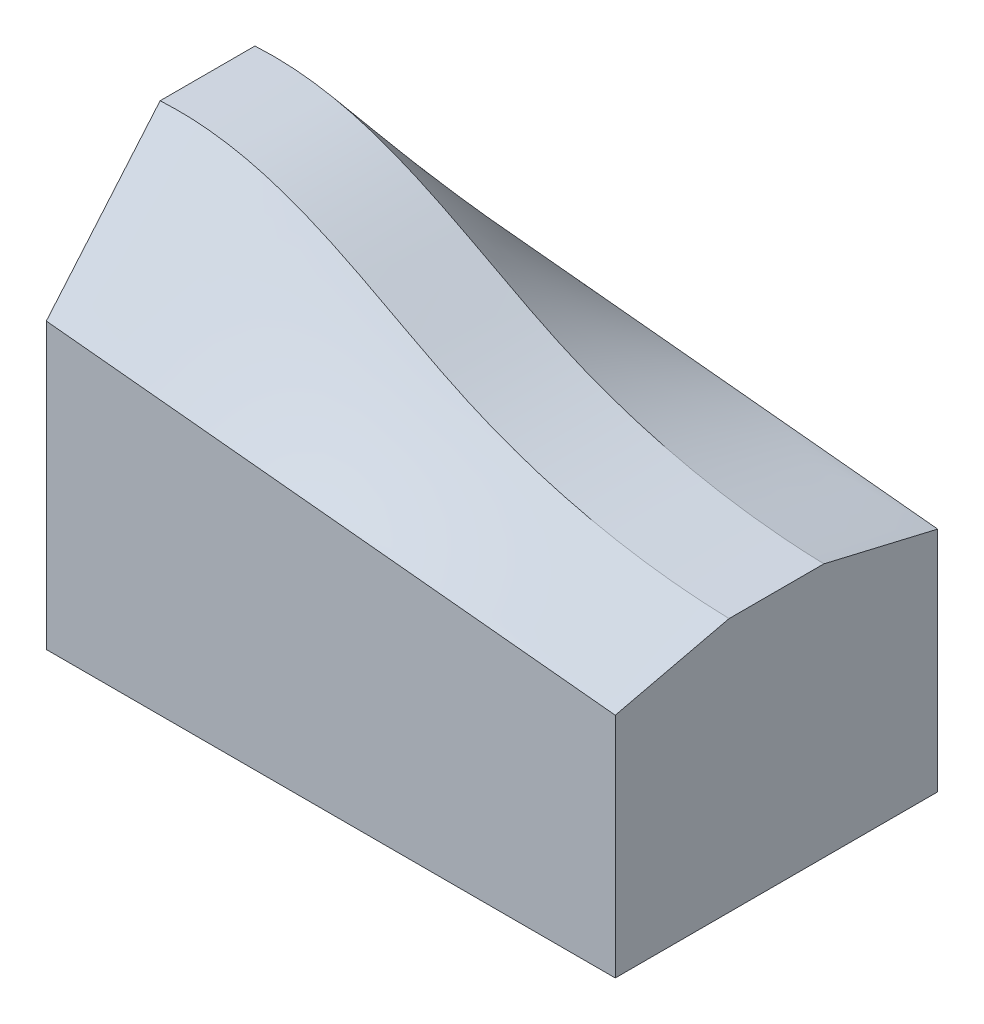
ISO-10303-21;
HEADER;
FILE_DESCRIPTION(('STEP AP214'),'2;1');
FILE_NAME('part.step','',(''),(''),'','','');
FILE_SCHEMA(('AUTOMOTIVE_DESIGN { 1 0 10303 214 1 1 1 1 }'));
ENDSEC;
DATA;
#1=APPLICATION_CONTEXT('core data for automotive mechanical design processes');
#2=APPLICATION_PROTOCOL_DEFINITION('international standard','automotive_design',2000,#1);
#3=PRODUCT_CONTEXT('',#1,'mechanical');
#4=PRODUCT('Part','Part','',(#3));
#5=PRODUCT_RELATED_PRODUCT_CATEGORY('part','',(#4));
#6=PRODUCT_DEFINITION_FORMATION('','',#4);
#7=PRODUCT_DEFINITION_CONTEXT('part definition',#1,'design');
#8=PRODUCT_DEFINITION('design','',#6,#7);
#9=PRODUCT_DEFINITION_SHAPE('','',#8);
#10=(LENGTH_UNIT() NAMED_UNIT(*) SI_UNIT(.MILLI.,.METRE.));
#11=(NAMED_UNIT(*) PLANE_ANGLE_UNIT() SI_UNIT($,.RADIAN.));
#12=(NAMED_UNIT(*) SI_UNIT($,.STERADIAN.) SOLID_ANGLE_UNIT());
#13=UNCERTAINTY_MEASURE_WITH_UNIT(LENGTH_MEASURE(1.E-05),#10,'distance_accuracy_value','');
#14=(GEOMETRIC_REPRESENTATION_CONTEXT(3) GLOBAL_UNCERTAINTY_ASSIGNED_CONTEXT((#13)) GLOBAL_UNIT_ASSIGNED_CONTEXT((#10,
#11,#12)) REPRESENTATION_CONTEXT('',''));
#15=CARTESIAN_POINT('',(0.,0.,0.));
#16=DIRECTION('',(0.,0.,1.));
#17=DIRECTION('',(1.,0.,0.));
#18=AXIS2_PLACEMENT_3D('',#15,#16,#17);
#19=CARTESIAN_POINT('',(3.16358629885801,7.32596468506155,2.50000000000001));
#20=CARTESIAN_POINT('',(2.63634932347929,7.34026394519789,2.50000000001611));
#21=CARTESIAN_POINT('',(2.10909878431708,7.35456357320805,2.50000000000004));
#22=CARTESIAN_POINT('',(1.31820231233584,7.37601357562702,2.50000000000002));
#23=CARTESIAN_POINT('',(1.05456671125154,7.38316366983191,2.50000000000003));
#24=CARTESIAN_POINT('',(0.659108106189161,7.39388895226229,2.50000000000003));
#25=CARTESIAN_POINT('',(0.527287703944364,7.39746406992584,2.50000000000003));
#26=CARTESIAN_POINT('',(0.263645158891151,7.40461435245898,2.50000000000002));
#27=CARTESIAN_POINT('',(0.131823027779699,7.40818947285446,2.50000018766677));
#28=CARTESIAN_POINT('',(-0.164778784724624,7.41623374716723,2.49999976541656));
#29=CARTESIAN_POINT('',(-0.289547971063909,7.42042110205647,2.49999999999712));
#30=CARTESIAN_POINT('',(-0.57800217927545,7.43143505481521,2.50000000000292));
#31=CARTESIAN_POINT('',(-0.72200883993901,7.43772946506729,2.49999999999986));
#32=CARTESIAN_POINT('',(-1.15339398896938,7.45895841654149,2.50000000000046));
#33=CARTESIAN_POINT('',(-1.4401375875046,7.47623749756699,2.49999999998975));
#34=CARTESIAN_POINT('',(-2.29804392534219,7.5373645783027,2.50000000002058));
#35=CARTESIAN_POINT('',(-2.86688276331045,7.59048407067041,2.50000000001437));
#36=CARTESIAN_POINT('',(-4.5658331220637,7.78690213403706,2.49999999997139));
#37=CARTESIAN_POINT('',(-5.68843891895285,7.96695883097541,2.50000000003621));
#38=CARTESIAN_POINT('',(-7.922081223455,8.4321767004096,2.49999999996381));
#39=CARTESIAN_POINT('',(-9.03819871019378,8.7189642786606,2.50000000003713));
#40=CARTESIAN_POINT('',(-11.2378363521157,9.40598581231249,2.49999999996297));
#41=CARTESIAN_POINT('',(-12.3193114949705,9.80496227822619,2.50000000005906));
#42=CARTESIAN_POINT('',(-14.4444547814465,10.7305007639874,2.49999999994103));
#43=CARTESIAN_POINT('',(-15.5453785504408,11.28619009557,2.49999999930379));
#44=CARTESIAN_POINT('',(-17.9244576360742,12.5421425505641,2.50000000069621));
#45=CARTESIAN_POINT('',(-19.1963021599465,13.2411888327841,2.49999999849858));
#46=CARTESIAN_POINT('',(-21.9403008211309,14.5553199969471,2.50000000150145));
#47=CARTESIAN_POINT('',(-23.4083820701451,15.1626577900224,2.49999999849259));
#48=CARTESIAN_POINT('',(-25.7844350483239,15.7704303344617,2.50000000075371));
#49=CARTESIAN_POINT('',(-26.6046193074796,15.9218251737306,2.49999999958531));
#50=CARTESIAN_POINT('',(-27.8687220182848,16.0493421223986,2.50000000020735));
#51=CARTESIAN_POINT('',(-28.295378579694,16.0752174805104,2.50000000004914));
#52=CARTESIAN_POINT('',(-28.9344923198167,16.0881115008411,2.49999999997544));
#53=CARTESIAN_POINT('',(-29.147674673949,16.0881379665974,2.50000000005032));
#54=CARTESIAN_POINT('',(-29.5739723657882,16.0797574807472,2.49999999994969));
#55=CARTESIAN_POINT('',(-29.787087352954,16.0713484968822,2.50000207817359));
#56=CARTESIAN_POINT('',(-30.0851650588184,16.0538135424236,2.49999916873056));
#57=CARTESIAN_POINT('',(-30.1410391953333,16.0505250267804,2.5));
#58=CARTESIAN_POINT('',(-30.2719385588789,16.0428231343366,2.49999999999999));
#59=CARTESIAN_POINT('',(-30.3373886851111,16.0389721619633,2.50000000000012));
#60=CARTESIAN_POINT('',(-30.5337404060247,16.0274191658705,2.49999999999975));
#61=CARTESIAN_POINT('',(-30.6646433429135,16.019717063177,2.49999999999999));
#62=CARTESIAN_POINT('',(-31.057357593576,15.9966104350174,2.5));
#63=CARTESIAN_POINT('',(-31.3191743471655,15.9812055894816,2.50000000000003));
#64=CARTESIAN_POINT('',(-32.104646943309,15.9349897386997,2.49999999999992));
#65=CARTESIAN_POINT('',(-32.6283251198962,15.904177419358,2.49999999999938));
#66=CARTESIAN_POINT('',(-33.1520346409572,15.8733632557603,2.5));
#67=CARTESIAN_POINT('',(3.163586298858,7.32596468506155,-2.49999999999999));
#68=CARTESIAN_POINT('',(2.6363493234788,7.3402639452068,-2.49999999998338));
#69=CARTESIAN_POINT('',(2.10909878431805,7.35456357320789,-2.50000000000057));
#70=CARTESIAN_POINT('',(1.31820231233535,7.37601357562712,-2.49999999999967));
#71=CARTESIAN_POINT('',(1.05456671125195,7.38316366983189,-2.50000000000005));
#72=CARTESIAN_POINT('',(0.659108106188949,7.39388895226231,-2.49999999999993));
#73=CARTESIAN_POINT('',(0.527287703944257,7.3974640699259,-2.49999999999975));
#74=CARTESIAN_POINT('',(0.263645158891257,7.40461435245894,-2.50000000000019));
#75=CARTESIAN_POINT('',(0.131823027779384,7.40818947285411,-2.50000018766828));
#76=CARTESIAN_POINT('',(-0.164778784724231,7.41623374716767,-2.49999976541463));
#77=CARTESIAN_POINT('',(-0.28954797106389,7.42042110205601,-2.49999999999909));
#78=CARTESIAN_POINT('',(-0.578002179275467,7.43143505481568,-2.50000000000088));
#79=CARTESIAN_POINT('',(-0.722008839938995,7.43772946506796,-2.49999999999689));
#80=CARTESIAN_POINT('',(-1.1533939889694,7.45895841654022,-2.50000000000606));
#81=CARTESIAN_POINT('',(-1.44013758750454,7.47623749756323,-2.50000000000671));
#82=CARTESIAN_POINT('',(-2.29804392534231,7.53736457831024,-2.49999999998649));
#83=CARTESIAN_POINT('',(-2.86688276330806,7.59048407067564,-2.49999999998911));
#84=CARTESIAN_POINT('',(-4.56583312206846,7.78690213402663,-2.50000000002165));
#85=CARTESIAN_POINT('',(-5.68843891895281,7.96695883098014,-2.50000000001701));
#86=CARTESIAN_POINT('',(-7.92208122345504,8.43217670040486,-2.49999999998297));
#87=CARTESIAN_POINT('',(-9.03819871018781,8.71896427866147,-2.50000000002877));
#88=CARTESIAN_POINT('',(-11.2378363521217,9.40598581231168,-2.49999999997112));
#89=CARTESIAN_POINT('',(-12.3193114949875,9.8049622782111,-2.500000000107));
#90=CARTESIAN_POINT('',(-14.4444547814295,10.7305007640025,-2.49999999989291));
#91=CARTESIAN_POINT('',(-15.5453785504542,11.2861900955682,-2.49999999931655));
#92=CARTESIAN_POINT('',(-17.9244576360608,12.542142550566,-2.50000000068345));
#93=CARTESIAN_POINT('',(-19.1963021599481,13.2411888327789,-2.49999999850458));
#94=CARTESIAN_POINT('',(-21.9403008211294,14.5553199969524,-2.50000000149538));
#95=CARTESIAN_POINT('',(-23.4083820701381,15.1626577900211,-2.49999999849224));
#96=CARTESIAN_POINT('',(-25.7844350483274,15.7704303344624,-2.50000000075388));
#97=CARTESIAN_POINT('',(-26.604619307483,15.9218251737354,-2.49999999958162));
#98=CARTESIAN_POINT('',(-27.8687220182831,16.0493421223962,-2.50000000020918));
#99=CARTESIAN_POINT('',(-28.2953785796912,16.0752174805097,-2.50000000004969));
#100=CARTESIAN_POINT('',(-28.9344923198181,16.0881115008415,-2.49999999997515));
#101=CARTESIAN_POINT('',(-29.1476746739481,16.0881379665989,-2.50000000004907));
#102=CARTESIAN_POINT('',(-29.5739723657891,16.0797574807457,-2.49999999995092));
#103=CARTESIAN_POINT('',(-29.787087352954,16.0713484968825,-2.5000020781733));
#104=CARTESIAN_POINT('',(-30.0851650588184,16.0538135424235,-2.49999916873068));
#105=CARTESIAN_POINT('',(-30.1410391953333,16.0505250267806,-2.49999999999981));
#106=CARTESIAN_POINT('',(-30.2719385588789,16.0428231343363,-2.5000000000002));
#107=CARTESIAN_POINT('',(-30.3373886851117,16.0389721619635,-2.49999999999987));
#108=CARTESIAN_POINT('',(-30.5337404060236,16.02741916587,-2.50000000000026));
#109=CARTESIAN_POINT('',(-30.6646433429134,16.019717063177,-2.5));
#110=CARTESIAN_POINT('',(-31.057357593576,15.9966104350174,-2.50000000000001));
#111=CARTESIAN_POINT('',(-31.3191743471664,15.9812055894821,-2.49999999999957));
#112=CARTESIAN_POINT('',(-32.1046469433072,15.9349897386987,-2.50000000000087));
#113=CARTESIAN_POINT('',(-32.6283251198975,15.9041774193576,-2.49999999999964));
#114=CARTESIAN_POINT('',(-33.1520346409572,15.8733632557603,-2.5));
#115=B_SPLINE_SURFACE_WITH_KNOTS('',1,3,((#19,#20,#21,#22,#23,#24,#25,#26,#27,#28,#29,#30,#31,
#32,#33,#34,#35,#36,#37,#38,#39,#40,#41,#42,#43,#44,#45,#46,#47,#48,#49,#50,#51,#52,#53,#54,#55,
#56,#57,#58,#59,#60,#61,#62,#63,#64,#65,#66),(#67,#68,#69,#70,#71,#72,#73,#74,#75,#76,#77,#78,
#79,#80,#81,#82,#83,#84,#85,#86,#87,#88,#89,#90,#91,#92,#93,#94,#95,#96,#97,#98,#99,#100,#101,
#102,#103,#104,#105,#106,#107,#108,#109,#110,#111,#112,#113,#114)),.UNSPECIFIED.,.F.,.F.,.F.,(2,
2),(4,2,2,2,2,2,2,2,2,2,2,2,2,2,2,2,2,2,2,2,2,2,2,4),(0.,1.),(0.00714343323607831,
0.00872139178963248,0.00951037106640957,0.00990486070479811,0.0102993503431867,
0.0107924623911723,0.011285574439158,0.0122717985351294,0.0142442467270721,0.0181891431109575,
0.0221340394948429,0.0260789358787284,0.0300238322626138,0.0339687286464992,0.0379136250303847,
0.0398860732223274,0.0408722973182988,0.0413654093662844,0.0418585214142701,0.0420557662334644,
0.0422530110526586,0.0426475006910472,0.0434364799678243,0.0450144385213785),.UNSPECIFIED.);
#116=CARTESIAN_POINT('',(0.,7.41176470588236,2.50000000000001));
#117=CARTESIAN_POINT('',(-4.5771550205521,7.53590230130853,2.50000000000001));
#118=CARTESIAN_POINT('',(-15.3083363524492,9.67056029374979,2.50000000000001));
#119=CARTESIAN_POINT('',(-23.2907730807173,16.4535828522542,2.50000000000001));
#120=CARTESIAN_POINT('',(-30.,16.0588235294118,2.50000000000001));
#121=B_SPLINE_CURVE_WITH_KNOTS('',3,(#116,#117,#118,#119,#120),.UNSPECIFIED.,.F.,.F.,(4,1,4),
(0.,0.43459880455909,1.),.UNSPECIFIED.);
#122=CARTESIAN_POINT('',(0.,7.41176470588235,2.50000000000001));
#123=VERTEX_POINT('',#122);
#124=CARTESIAN_POINT('',(-30.,16.0588235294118,2.5));
#125=VERTEX_POINT('',#124);
#126=EDGE_CURVE('E330',#123,#125,#121,.T.);
#127=DIRECTION('',(0.,0.,-1.));
#128=VECTOR('',#127,1.);
#129=CARTESIAN_POINT('',(0.,7.41176470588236,-2.49999999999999));
#130=LINE('',#129,#128);
#131=CARTESIAN_POINT('',(0.,7.41176470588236,-2.49999999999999));
#132=VERTEX_POINT('',#131);
#133=EDGE_CURVE('E119',#132,#123,#130,.F.);
#134=CARTESIAN_POINT('',(-30.,16.0588235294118,-2.5));
#135=CARTESIAN_POINT('',(-23.2907730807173,16.4535828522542,-2.5));
#136=CARTESIAN_POINT('',(-15.3083363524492,9.67056029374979,-2.5));
#137=CARTESIAN_POINT('',(-4.57715502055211,7.53590230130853,-2.5));
#138=CARTESIAN_POINT('',(0.,7.41176470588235,-2.5));
#139=B_SPLINE_CURVE_WITH_KNOTS('',3,(#134,#135,#136,#137,#138),.UNSPECIFIED.,.F.,.F.,(4,1,4),
(0.,0.56540119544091,1.),.UNSPECIFIED.);
#140=CARTESIAN_POINT('',(-30.,16.0588235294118,-2.5));
#141=VERTEX_POINT('',#140);
#142=EDGE_CURVE('E454',#141,#132,#139,.T.);
#143=DIRECTION('',(0.,0.,-1.));
#144=VECTOR('',#143,1.);
#145=CARTESIAN_POINT('',(-30.,16.0588235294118,2.5));
#146=LINE('',#145,#144);
#147=EDGE_CURVE('E14',#125,#141,#146,.T.);
#148=ORIENTED_EDGE('',*,*,#126,.F.);
#149=ORIENTED_EDGE('',*,*,#133,.F.);
#150=ORIENTED_EDGE('',*,*,#142,.F.);
#151=ORIENTED_EDGE('',*,*,#147,.F.);
#152=EDGE_LOOP('',(#148,#149,#150,#151));
#153=FACE_BOUND('',#152,.T.);
#154=ADVANCED_FACE('F107',(#153),#115,.T.);
#155=CARTESIAN_POINT('',(-30.,0.,0.));
#156=DIRECTION('',(1.,0.,0.));
#157=DIRECTION('',(0.,0.,-1.));
#158=AXIS2_PLACEMENT_3D('',#155,#156,#157);
#159=PLANE('',#158);
#160=DIRECTION('',(0.,-0.761939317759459,0.64764842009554));
#161=VECTOR('',#160,1.);
#162=CARTESIAN_POINT('',(-30.,9.,8.5));
#163=LINE('',#162,#161);
#164=CARTESIAN_POINT('',(-30.,9.,8.5));
#165=VERTEX_POINT('',#164);
#166=EDGE_CURVE('E328',#125,#165,#163,.T.);
#167=ORIENTED_EDGE('',*,*,#166,.F.);
#168=ORIENTED_EDGE('',*,*,#147,.T.);
#169=DIRECTION('',(0.,0.761939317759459,0.647648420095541));
#170=VECTOR('',#169,1.);
#171=CARTESIAN_POINT('',(-30.,19.,0.));
#172=LINE('',#171,#170);
#173=CARTESIAN_POINT('',(-30.,9.,-8.5));
#174=VERTEX_POINT('',#173);
#175=EDGE_CURVE('E279',#174,#141,#172,.T.);
#176=ORIENTED_EDGE('',*,*,#175,.F.);
#177=DIRECTION('',(0.,1.,0.));
#178=VECTOR('',#177,1.);
#179=CARTESIAN_POINT('',(-30.,-6.,-8.5));
#180=LINE('',#179,#178);
#181=CARTESIAN_POINT('',(-30.,-6.,-8.5));
#182=VERTEX_POINT('',#181);
#183=EDGE_CURVE('E358',#182,#174,#180,.T.);
#184=ORIENTED_EDGE('',*,*,#183,.F.);
#185=DIRECTION('',(0.,0.,-1.));
#186=VECTOR('',#185,1.);
#187=CARTESIAN_POINT('',(-30.,-6.,8.5));
#188=LINE('',#187,#186);
#189=CARTESIAN_POINT('',(-30.,-6.,8.49999999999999));
#190=VERTEX_POINT('',#189);
#191=EDGE_CURVE('E198',#190,#182,#188,.T.);
#192=ORIENTED_EDGE('',*,*,#191,.F.);
#193=DIRECTION('',(0.,-1.,0.));
#194=VECTOR('',#193,1.);
#195=CARTESIAN_POINT('',(-30.,-6.,8.5));
#196=LINE('',#195,#194);
#197=EDGE_CURVE('E331',#165,#190,#196,.T.);
#198=ORIENTED_EDGE('',*,*,#197,.F.);
#199=EDGE_LOOP('',(#167,#168,#176,#184,#192,#198));
#200=FACE_BOUND('',#199,.T.);
#201=ADVANCED_FACE('F251',(#200),#159,.F.);
#202=CARTESIAN_POINT('',(0.,0.,0.));
#203=DIRECTION('',(1.,0.,0.));
#204=DIRECTION('',(0.,0.,-1.));
#205=AXIS2_PLACEMENT_3D('',#202,#203,#204);
#206=PLANE('',#205);
#207=DIRECTION('',(0.,0.229039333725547,0.973417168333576));
#208=VECTOR('',#207,1.);
#209=CARTESIAN_POINT('',(0.,8.,0.));
#210=LINE('',#209,#208);
#211=CARTESIAN_POINT('',(0.,6.,-8.5));
#212=VERTEX_POINT('',#211);
#213=EDGE_CURVE('E192',#212,#132,#210,.T.);
#214=ORIENTED_EDGE('',*,*,#213,.T.);
#215=ORIENTED_EDGE('',*,*,#133,.T.);
#216=DIRECTION('',(0.,-0.229039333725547,0.973417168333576));
#217=VECTOR('',#216,1.);
#218=CARTESIAN_POINT('',(0.,6.,8.5));
#219=LINE('',#218,#217);
#220=CARTESIAN_POINT('',(0.,6.,8.5));
#221=VERTEX_POINT('',#220);
#222=EDGE_CURVE('E204',#123,#221,#219,.T.);
#223=ORIENTED_EDGE('',*,*,#222,.T.);
#224=DIRECTION('',(0.,-1.,0.));
#225=VECTOR('',#224,1.);
#226=CARTESIAN_POINT('',(0.,-6.,8.5));
#227=LINE('',#226,#225);
#228=CARTESIAN_POINT('',(0.,-6.,8.5));
#229=VERTEX_POINT('',#228);
#230=EDGE_CURVE('E173',#221,#229,#227,.T.);
#231=ORIENTED_EDGE('',*,*,#230,.T.);
#232=DIRECTION('',(0.,0.,-1.));
#233=VECTOR('',#232,1.);
#234=CARTESIAN_POINT('',(0.,-6.,8.5));
#235=LINE('',#234,#233);
#236=CARTESIAN_POINT('',(0.,-6.,-8.5));
#237=VERTEX_POINT('',#236);
#238=EDGE_CURVE('E164',#229,#237,#235,.T.);
#239=ORIENTED_EDGE('',*,*,#238,.T.);
#240=DIRECTION('',(0.,1.,0.));
#241=VECTOR('',#240,1.);
#242=CARTESIAN_POINT('',(0.,-6.,-8.5));
#243=LINE('',#242,#241);
#244=EDGE_CURVE('E169',#237,#212,#243,.T.);
#245=ORIENTED_EDGE('',*,*,#244,.T.);
#246=EDGE_LOOP('',(#214,#215,#223,#231,#239,#245));
#247=FACE_BOUND('',#246,.T.);
#248=ADVANCED_FACE('F168',(#247),#206,.T.);
#249=CARTESIAN_POINT('',(0.,6.,8.5));
#250=CARTESIAN_POINT('',(-4.3459880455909,6.43459880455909,8.5));
#251=CARTESIAN_POINT('',(-14.3459880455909,7.43459880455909,8.5));
#252=CARTESIAN_POINT('',(-24.3459880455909,8.43459880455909,8.5));
#253=CARTESIAN_POINT('',(-30.,9.,8.5));
#254=CARTESIAN_POINT('',(0.,6.16666666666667,7.79166666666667));
#255=CARTESIAN_POINT('',(-4.37327859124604,6.56461380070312,7.79166666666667));
#256=CARTESIAN_POINT('',(-14.459598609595,7.69856648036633,7.79166666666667));
#257=CARTESIAN_POINT('',(-24.2214140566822,9.38128442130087,7.79166666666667));
#258=CARTESIAN_POINT('',(-30.,9.83333333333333,7.79166666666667));
#259=CARTESIAN_POINT('',(0.,6.50000000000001,6.375));
#260=CARTESIAN_POINT('',(-4.42785968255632,6.8246437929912,6.375));
#261=CARTESIAN_POINT('',(-14.6868197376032,8.22650183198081,6.375));
#262=CARTESIAN_POINT('',(-23.9722660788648,11.2746556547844,6.37499999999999));
#263=CARTESIAN_POINT('',(-30.,11.5,6.37499999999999));
#264=CARTESIAN_POINT('',(0.,6.99999999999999,4.25000000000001));
#265=CARTESIAN_POINT('',(-4.50973131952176,7.21468878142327,4.25000000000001));
#266=CARTESIAN_POINT('',(-15.0276514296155,9.0184048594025,4.25000000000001));
#267=CARTESIAN_POINT('',(-23.5985441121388,14.1147125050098,4.25000000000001));
#268=CARTESIAN_POINT('',(-30.,14.,4.25000000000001));
#269=CARTESIAN_POINT('',(0.,7.50000000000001,2.12499999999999));
#270=CARTESIAN_POINT('',(-4.59160295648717,7.60473376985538,2.12499999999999));
#271=CARTESIAN_POINT('',(-15.3684831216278,9.81030788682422,2.12499999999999));
#272=CARTESIAN_POINT('',(-23.2248221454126,16.9547693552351,2.12499999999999));
#273=CARTESIAN_POINT('',(-30.,16.5,2.12499999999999));
#274=CARTESIAN_POINT('',(0.,7.83333333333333,0.708333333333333));
#275=CARTESIAN_POINT('',(-4.64618404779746,7.86476376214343,0.708333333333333));
#276=CARTESIAN_POINT('',(-15.5957042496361,10.3382432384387,0.708333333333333));
#277=CARTESIAN_POINT('',(-22.9756741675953,18.8481405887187,0.708333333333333));
#278=CARTESIAN_POINT('',(-30.,18.1666666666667,0.708333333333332));
#279=CARTESIAN_POINT('',(0.,8.,0.));
#280=CARTESIAN_POINT('',(-4.67347459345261,7.99477875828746,0.));
#281=CARTESIAN_POINT('',(-15.7093148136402,10.6022109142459,0.));
#282=CARTESIAN_POINT('',(-22.8511001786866,19.7948262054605,0.));
#283=CARTESIAN_POINT('',(-30.,19.,0.));
#284=B_SPLINE_SURFACE_WITH_KNOTS('',3,3,((#249,#250,#251,#252,#253),(#254,#255,#256,#257,#258),
(#259,#260,#261,#262,#263),(#264,#265,#266,#267,#268),(#269,#270,#271,#272,#273),(#274,#275,
#276,#277,#278),(#279,#280,#281,#282,#283)),.UNSPECIFIED.,.F.,.F.,.F.,(4,1,1,1,4),(4,1,4),
(0.835732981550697,0.876799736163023,0.917866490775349,0.958933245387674,1.),(0.,
0.43459880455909,1.),.UNSPECIFIED.);
#285=CARTESIAN_POINT('',(0.,6.,8.5));
#286=CARTESIAN_POINT('',(-4.3459880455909,6.43459880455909,8.5));
#287=CARTESIAN_POINT('',(-14.3459880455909,7.43459880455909,8.5));
#288=CARTESIAN_POINT('',(-24.3459880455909,8.43459880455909,8.5));
#289=CARTESIAN_POINT('',(-30.,9.,8.5));
#290=B_SPLINE_CURVE_WITH_KNOTS('',3,(#285,#286,#287,#288,#289),.UNSPECIFIED.,.F.,.F.,(4,1,4),
(0.,0.43459880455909,1.),.UNSPECIFIED.);
#291=EDGE_CURVE('E202',#221,#165,#290,.T.);
#292=ORIENTED_EDGE('',*,*,#222,.F.);
#293=ORIENTED_EDGE('',*,*,#126,.T.);
#294=ORIENTED_EDGE('',*,*,#166,.T.);
#295=ORIENTED_EDGE('',*,*,#291,.F.);
#296=EDGE_LOOP('',(#292,#293,#294,#295));
#297=FACE_BOUND('',#296,.T.);
#298=ADVANCED_FACE('F232',(#297),#284,.T.);
#299=CARTESIAN_POINT('',(0.,-6.,8.5));
#300=DIRECTION('',(0.,0.,1.));
#301=DIRECTION('',(0.,1.,0.));
#302=AXIS2_PLACEMENT_3D('',#299,#300,#301);
#303=PLANE('',#302);
#304=ORIENTED_EDGE('',*,*,#230,.F.);
#305=ORIENTED_EDGE('',*,*,#291,.T.);
#306=ORIENTED_EDGE('',*,*,#197,.T.);
#307=CARTESIAN_POINT('',(0.,-6.,8.5));
#308=CARTESIAN_POINT('',(-4.3459880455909,-6.,8.5));
#309=CARTESIAN_POINT('',(-14.3459880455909,-6.,8.5));
#310=CARTESIAN_POINT('',(-24.3459880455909,-6.,8.5));
#311=CARTESIAN_POINT('',(-30.,-6.,8.49999999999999));
#312=B_SPLINE_CURVE_WITH_KNOTS('',3,(#307,#308,#309,#310,#311),.UNSPECIFIED.,.F.,.F.,(4,1,4),
(0.,0.43459880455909,1.),.UNSPECIFIED.);
#313=EDGE_CURVE('E200',#229,#190,#312,.T.);
#314=ORIENTED_EDGE('',*,*,#313,.F.);
#315=EDGE_LOOP('',(#304,#305,#306,#314));
#316=FACE_BOUND('',#315,.T.);
#317=ADVANCED_FACE('F244',(#316),#303,.T.);
#318=CARTESIAN_POINT('',(0.,-6.,-8.5));
#319=DIRECTION('',(0.,-1.,0.));
#320=DIRECTION('',(0.,0.,1.));
#321=AXIS2_PLACEMENT_3D('',#318,#319,#320);
#322=PLANE('',#321);
#323=ORIENTED_EDGE('',*,*,#238,.F.);
#324=ORIENTED_EDGE('',*,*,#313,.T.);
#325=ORIENTED_EDGE('',*,*,#191,.T.);
#326=CARTESIAN_POINT('',(0.,-6.,-8.5));
#327=CARTESIAN_POINT('',(-4.3459880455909,-6.,-8.5));
#328=CARTESIAN_POINT('',(-14.3459880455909,-6.,-8.5));
#329=CARTESIAN_POINT('',(-24.3459880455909,-6.,-8.5));
#330=CARTESIAN_POINT('',(-30.,-6.,-8.5));
#331=B_SPLINE_CURVE_WITH_KNOTS('',3,(#326,#327,#328,#329,#330),.UNSPECIFIED.,.F.,.F.,(4,1,4),
(0.,0.43459880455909,1.),.UNSPECIFIED.);
#332=EDGE_CURVE('E188',#237,#182,#331,.T.);
#333=ORIENTED_EDGE('',*,*,#332,.F.);
#334=EDGE_LOOP('',(#323,#324,#325,#333));
#335=FACE_BOUND('',#334,.T.);
#336=ADVANCED_FACE('F196',(#335),#322,.T.);
#337=CARTESIAN_POINT('',(0.,6.,-8.5));
#338=DIRECTION('',(0.,0.,-1.));
#339=DIRECTION('',(0.,-1.,0.));
#340=AXIS2_PLACEMENT_3D('',#337,#338,#339);
#341=PLANE('',#340);
#342=ORIENTED_EDGE('',*,*,#244,.F.);
#343=ORIENTED_EDGE('',*,*,#332,.T.);
#344=ORIENTED_EDGE('',*,*,#183,.T.);
#345=CARTESIAN_POINT('',(0.,6.,-8.5));
#346=CARTESIAN_POINT('',(-4.3459880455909,6.43459880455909,-8.5));
#347=CARTESIAN_POINT('',(-14.3459880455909,7.43459880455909,-8.5));
#348=CARTESIAN_POINT('',(-24.3459880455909,8.43459880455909,-8.5));
#349=CARTESIAN_POINT('',(-30.,9.,-8.5));
#350=B_SPLINE_CURVE_WITH_KNOTS('',3,(#345,#346,#347,#348,#349),.UNSPECIFIED.,.F.,.F.,(4,1,4),
(0.,0.43459880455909,1.),.UNSPECIFIED.);
#351=EDGE_CURVE('E191',#212,#174,#350,.T.);
#352=ORIENTED_EDGE('',*,*,#351,.F.);
#353=EDGE_LOOP('',(#342,#343,#344,#352));
#354=FACE_BOUND('',#353,.T.);
#355=ADVANCED_FACE('F187',(#354),#341,.T.);
#356=CARTESIAN_POINT('',(0.,8.,0.));
#357=CARTESIAN_POINT('',(-4.67347459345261,7.99477875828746,0.));
#358=CARTESIAN_POINT('',(-15.7093148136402,10.6022109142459,0.));
#359=CARTESIAN_POINT('',(-22.8511001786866,19.7948262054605,0.));
#360=CARTESIAN_POINT('',(-30.,19.,0.));
#361=CARTESIAN_POINT('',(0.,7.83333333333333,-0.708333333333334));
#362=CARTESIAN_POINT('',(-4.64618404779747,7.86476376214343,-0.708333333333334));
#363=CARTESIAN_POINT('',(-15.5957042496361,10.3382432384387,-0.708333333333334));
#364=CARTESIAN_POINT('',(-22.9756741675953,18.8481405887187,-0.708333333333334));
#365=CARTESIAN_POINT('',(-30.,18.1666666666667,-0.708333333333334));
#366=CARTESIAN_POINT('',(0.,7.5,-2.125));
#367=CARTESIAN_POINT('',(-4.59160295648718,7.60473376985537,-2.125));
#368=CARTESIAN_POINT('',(-15.3684831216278,9.81030788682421,-2.125));
#369=CARTESIAN_POINT('',(-23.2248221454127,16.9547693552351,-2.125));
#370=CARTESIAN_POINT('',(-30.,16.5,-2.125));
#371=CARTESIAN_POINT('',(0.,7.,-4.25000000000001));
#372=CARTESIAN_POINT('',(-4.50973131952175,7.21468878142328,-4.25000000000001));
#373=CARTESIAN_POINT('',(-15.0276514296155,9.01840485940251,-4.25000000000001));
#374=CARTESIAN_POINT('',(-23.5985441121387,14.1147125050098,-4.25000000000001));
#375=CARTESIAN_POINT('',(-30.,14.,-4.25000000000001));
#376=CARTESIAN_POINT('',(0.,6.5,-6.37499999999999));
#377=CARTESIAN_POINT('',(-4.42785968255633,6.82464379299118,-6.37499999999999));
#378=CARTESIAN_POINT('',(-14.6868197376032,8.22650183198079,-6.375));
#379=CARTESIAN_POINT('',(-23.9722660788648,11.2746556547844,-6.375));
#380=CARTESIAN_POINT('',(-30.,11.5,-6.375));
#381=CARTESIAN_POINT('',(0.,6.16666666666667,-7.79166666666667));
#382=CARTESIAN_POINT('',(-4.37327859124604,6.56461380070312,-7.79166666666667));
#383=CARTESIAN_POINT('',(-14.459598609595,7.69856648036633,-7.79166666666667));
#384=CARTESIAN_POINT('',(-24.2214140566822,9.38128442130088,-7.79166666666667));
#385=CARTESIAN_POINT('',(-30.,9.83333333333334,-7.79166666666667));
#386=CARTESIAN_POINT('',(0.,6.,-8.5));
#387=CARTESIAN_POINT('',(-4.3459880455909,6.43459880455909,-8.5));
#388=CARTESIAN_POINT('',(-14.3459880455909,7.43459880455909,-8.5));
#389=CARTESIAN_POINT('',(-24.3459880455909,8.43459880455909,-8.5));
#390=CARTESIAN_POINT('',(-30.,9.,-8.5));
#391=B_SPLINE_SURFACE_WITH_KNOTS('',3,3,((#356,#357,#358,#359,#360),(#361,#362,#363,#364,#365),
(#366,#367,#368,#369,#370),(#371,#372,#373,#374,#375),(#376,#377,#378,#379,#380),(#381,#382,
#383,#384,#385),(#386,#387,#388,#389,#390)),.UNSPECIFIED.,.F.,.F.,.F.,(4,1,1,1,4),(4,1,4),(0.,
0.0410667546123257,0.0821335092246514,0.123200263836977,0.164267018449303),(0.,0.43459880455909,
1.),.UNSPECIFIED.);
#392=ORIENTED_EDGE('',*,*,#175,.T.);
#393=ORIENTED_EDGE('',*,*,#142,.T.);
#394=ORIENTED_EDGE('',*,*,#213,.F.);
#395=ORIENTED_EDGE('',*,*,#351,.T.);
#396=EDGE_LOOP('',(#392,#393,#394,#395));
#397=FACE_BOUND('',#396,.T.);
#398=ADVANCED_FACE('F246',(#397),#391,.T.);
#399=CLOSED_SHELL('',(#154,#201,#248,#298,#317,#336,#355,#398));
#400=MANIFOLD_SOLID_BREP('B2',#399);
#401=ADVANCED_BREP_SHAPE_REPRESENTATION('',(#18,#400),#14);
#402=SHAPE_DEFINITION_REPRESENTATION(#9,#401);
ENDSEC;
END-ISO-10303-21;
